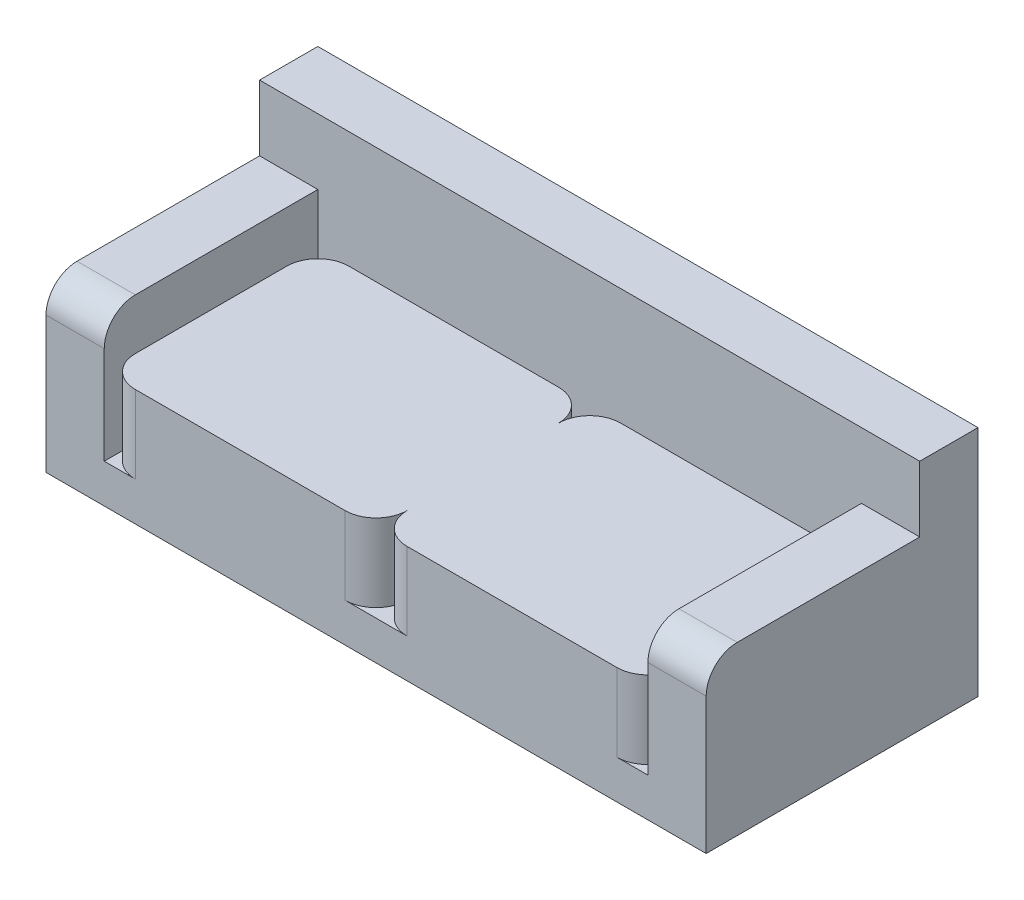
ISO-10303-21;
HEADER;
FILE_DESCRIPTION(('STEP AP214'),'2;1');
FILE_NAME('part.step','',(''),(''),'','','');
FILE_SCHEMA(('AUTOMOTIVE_DESIGN { 1 0 10303 214 1 1 1 1 }'));
ENDSEC;
DATA;
#1=APPLICATION_CONTEXT('core data for automotive mechanical design processes');
#2=APPLICATION_PROTOCOL_DEFINITION('international standard','automotive_design',2000,#1);
#3=PRODUCT_CONTEXT('',#1,'mechanical');
#4=PRODUCT('Part','Part','',(#3));
#5=PRODUCT_RELATED_PRODUCT_CATEGORY('part','',(#4));
#6=PRODUCT_DEFINITION_FORMATION('','',#4);
#7=PRODUCT_DEFINITION_CONTEXT('part definition',#1,'design');
#8=PRODUCT_DEFINITION('design','',#6,#7);
#9=PRODUCT_DEFINITION_SHAPE('','',#8);
#10=(LENGTH_UNIT() NAMED_UNIT(*) SI_UNIT(.MILLI.,.METRE.));
#11=(NAMED_UNIT(*) PLANE_ANGLE_UNIT() SI_UNIT($,.RADIAN.));
#12=(NAMED_UNIT(*) SI_UNIT($,.STERADIAN.) SOLID_ANGLE_UNIT());
#13=UNCERTAINTY_MEASURE_WITH_UNIT(LENGTH_MEASURE(1.E-05),#10,'distance_accuracy_value','');
#14=(GEOMETRIC_REPRESENTATION_CONTEXT(3) GLOBAL_UNCERTAINTY_ASSIGNED_CONTEXT((#13)) GLOBAL_UNIT_ASSIGNED_CONTEXT((#10,
#11,#12)) REPRESENTATION_CONTEXT('',''));
#15=CARTESIAN_POINT('',(0.,0.,0.));
#16=DIRECTION('',(0.,0.,1.));
#17=DIRECTION('',(1.,0.,0.));
#18=AXIS2_PLACEMENT_3D('',#15,#16,#17);
#19=CARTESIAN_POINT('',(0.,0.,0.));
#20=DIRECTION('',(0.,1.,0.));
#21=DIRECTION('',(0.,0.,1.));
#22=AXIS2_PLACEMENT_3D('',#19,#20,#21);
#23=PLANE('',#22);
#24=DIRECTION('',(1.,0.,0.));
#25=VECTOR('',#24,1.);
#26=CARTESIAN_POINT('',(1200.,0.,-275.));
#27=LINE('',#26,#25);
#28=CARTESIAN_POINT('',(-350.,0.,-275.));
#29=VERTEX_POINT('',#28);
#30=CARTESIAN_POINT('',(-270.,0.,-275.));
#31=VERTEX_POINT('',#30);
#32=EDGE_CURVE('E289',#29,#31,#27,.T.);
#33=ORIENTED_EDGE('',*,*,#32,.F.);
#34=DIRECTION('',(0.,0.,-1.));
#35=VECTOR('',#34,1.);
#36=CARTESIAN_POINT('',(-350.,0.,-275.));
#37=LINE('',#36,#35);
#38=CARTESIAN_POINT('',(-350.,0.,-195.));
#39=VERTEX_POINT('',#38);
#40=EDGE_CURVE('E232',#39,#29,#37,.T.);
#41=ORIENTED_EDGE('',*,*,#40,.F.);
#42=CARTESIAN_POINT('',(-270.,0.,-195.));
#43=DIRECTION('',(0.,1.,0.));
#44=DIRECTION('',(0.,0.,1.));
#45=AXIS2_PLACEMENT_3D('',#42,#43,#44);
#46=CIRCLE('',#45,80.);
#47=EDGE_CURVE('E417',#39,#31,#46,.F.);
#48=ORIENTED_EDGE('',*,*,#47,.T.);
#49=EDGE_LOOP('',(#33,#41,#48));
#50=FACE_BOUND('',#49,.T.);
#51=ADVANCED_FACE('F32',(#50),#23,.T.);
#52=CARTESIAN_POINT('',(-270.,0.,195.));
#53=DIRECTION('',(0.,1.,0.));
#54=DIRECTION('',(0.,0.,1.));
#55=AXIS2_PLACEMENT_3D('',#52,#53,#54);
#56=CIRCLE('',#55,80.);
#57=CARTESIAN_POINT('',(-270.,0.,275.));
#58=VERTEX_POINT('',#57);
#59=CARTESIAN_POINT('',(-350.,0.,195.));
#60=VERTEX_POINT('',#59);
#61=EDGE_CURVE('E421',#58,#60,#56,.F.);
#62=ORIENTED_EDGE('',*,*,#61,.T.);
#63=CARTESIAN_POINT('',(-350.,0.,275.));
#64=VERTEX_POINT('',#63);
#65=EDGE_CURVE('E235',#64,#60,#37,.T.);
#66=ORIENTED_EDGE('',*,*,#65,.F.);
#67=DIRECTION('',(-1.,0.,0.));
#68=VECTOR('',#67,1.);
#69=CARTESIAN_POINT('',(1200.,0.,275.));
#70=LINE('',#69,#68);
#71=EDGE_CURVE('E290',#58,#64,#70,.T.);
#72=ORIENTED_EDGE('',*,*,#71,.F.);
#73=EDGE_LOOP('',(#62,#66,#72));
#74=FACE_BOUND('',#73,.T.);
#75=ADVANCED_FACE('F442',(#74),#23,.T.);
#76=CARTESIAN_POINT('',(1050.,0.,275.));
#77=VERTEX_POINT('',#76);
#78=CARTESIAN_POINT('',(970.,0.,275.));
#79=VERTEX_POINT('',#78);
#80=EDGE_CURVE('E272',#77,#79,#70,.T.);
#81=ORIENTED_EDGE('',*,*,#80,.F.);
#82=DIRECTION('',(0.,0.,-1.));
#83=VECTOR('',#82,1.);
#84=CARTESIAN_POINT('',(1050.,0.,0.));
#85=LINE('',#84,#83);
#86=CARTESIAN_POINT('',(1050.,0.,195.));
#87=VERTEX_POINT('',#86);
#88=EDGE_CURVE('E374',#77,#87,#85,.T.);
#89=ORIENTED_EDGE('',*,*,#88,.T.);
#90=CARTESIAN_POINT('',(970.,0.,195.));
#91=DIRECTION('',(0.,1.,0.));
#92=DIRECTION('',(0.,0.,1.));
#93=AXIS2_PLACEMENT_3D('',#90,#91,#92);
#94=CIRCLE('',#93,80.);
#95=EDGE_CURVE('E386',#87,#79,#94,.F.);
#96=ORIENTED_EDGE('',*,*,#95,.T.);
#97=EDGE_LOOP('',(#81,#89,#96));
#98=FACE_BOUND('',#97,.T.);
#99=ADVANCED_FACE('F549',(#98),#23,.T.);
#100=CARTESIAN_POINT('',(970.,0.,-195.));
#101=DIRECTION('',(0.,1.,0.));
#102=DIRECTION('',(0.,0.,1.));
#103=AXIS2_PLACEMENT_3D('',#100,#101,#102);
#104=CIRCLE('',#103,80.);
#105=CARTESIAN_POINT('',(970.,0.,-275.));
#106=VERTEX_POINT('',#105);
#107=CARTESIAN_POINT('',(1050.,0.,-195.));
#108=VERTEX_POINT('',#107);
#109=EDGE_CURVE('E471',#106,#108,#104,.F.);
#110=ORIENTED_EDGE('',*,*,#109,.T.);
#111=DIRECTION('',(0.,0.,1.));
#112=VECTOR('',#111,1.);
#113=CARTESIAN_POINT('',(1050.,0.,-275.));
#114=LINE('',#113,#112);
#115=CARTESIAN_POINT('',(1050.,0.,-275.));
#116=VERTEX_POINT('',#115);
#117=EDGE_CURVE('E252',#116,#108,#114,.T.);
#118=ORIENTED_EDGE('',*,*,#117,.F.);
#119=EDGE_CURVE('E268',#106,#116,#27,.T.);
#120=ORIENTED_EDGE('',*,*,#119,.F.);
#121=EDGE_LOOP('',(#110,#118,#120));
#122=FACE_BOUND('',#121,.T.);
#123=ADVANCED_FACE('F551',(#122),#23,.T.);
#124=CARTESIAN_POINT('',(-350.,200.,275.));
#125=DIRECTION('',(0.,0.,-1.));
#126=DIRECTION('',(-1.,0.,0.));
#127=AXIS2_PLACEMENT_3D('',#124,#125,#126);
#128=PLANE('',#127);
#129=DIRECTION('',(0.,1.,0.));
#130=VECTOR('',#129,1.);
#131=CARTESIAN_POINT('',(1200.,-100.,275.));
#132=LINE('',#131,#130);
#133=CARTESIAN_POINT('',(1200.,-100.,275.));
#134=VERTEX_POINT('',#133);
#135=CARTESIAN_POINT('',(1200.,251.,275.));
#136=VERTEX_POINT('',#135);
#137=EDGE_CURVE('E296',#134,#136,#132,.T.);
#138=ORIENTED_EDGE('',*,*,#137,.T.);
#139=DIRECTION('',(1.,0.,0.));
#140=VECTOR('',#139,1.);
#141=CARTESIAN_POINT('',(-350.,251.,275.));
#142=LINE('',#141,#140);
#143=CARTESIAN_POINT('',(1050.,251.,275.));
#144=VERTEX_POINT('',#143);
#145=EDGE_CURVE('E332',#136,#144,#142,.F.);
#146=ORIENTED_EDGE('',*,*,#145,.T.);
#147=DIRECTION('',(0.,-1.,0.));
#148=VECTOR('',#147,1.);
#149=CARTESIAN_POINT('',(1050.,331.,275.));
#150=LINE('',#149,#148);
#151=EDGE_CURVE('E262',#144,#77,#150,.T.);
#152=ORIENTED_EDGE('',*,*,#151,.T.);
#153=ORIENTED_EDGE('',*,*,#80,.T.);
#154=DIRECTION('',(0.,-1.,0.));
#155=VECTOR('',#154,1.);
#156=CARTESIAN_POINT('',(970.,200.,275.));
#157=LINE('',#156,#155);
#158=CARTESIAN_POINT('',(970.,200.,275.));
#159=VERTEX_POINT('',#158);
#160=EDGE_CURVE('E387',#79,#159,#157,.F.);
#161=ORIENTED_EDGE('',*,*,#160,.T.);
#162=DIRECTION('',(1.,0.,0.));
#163=VECTOR('',#162,1.);
#164=CARTESIAN_POINT('',(350.,200.,275.));
#165=LINE('',#164,#163);
#166=CARTESIAN_POINT('',(430.,200.,275.));
#167=VERTEX_POINT('',#166);
#168=EDGE_CURVE('E518',#167,#159,#165,.T.);
#169=ORIENTED_EDGE('',*,*,#168,.F.);
#170=DIRECTION('',(0.,-1.,0.));
#171=VECTOR('',#170,1.);
#172=CARTESIAN_POINT('',(430.,200.,275.));
#173=LINE('',#172,#171);
#174=CARTESIAN_POINT('',(430.,0.,275.));
#175=VERTEX_POINT('',#174);
#176=EDGE_CURVE('E383',#167,#175,#173,.T.);
#177=ORIENTED_EDGE('',*,*,#176,.T.);
#178=CARTESIAN_POINT('',(270.,0.,275.));
#179=VERTEX_POINT('',#178);
#180=EDGE_CURVE('E293',#175,#179,#70,.T.);
#181=ORIENTED_EDGE('',*,*,#180,.T.);
#182=DIRECTION('',(0.,-1.,0.));
#183=VECTOR('',#182,1.);
#184=CARTESIAN_POINT('',(270.,200.,275.));
#185=LINE('',#184,#183);
#186=CARTESIAN_POINT('',(270.,200.,275.));
#187=VERTEX_POINT('',#186);
#188=EDGE_CURVE('E397',#179,#187,#185,.F.);
#189=ORIENTED_EDGE('',*,*,#188,.T.);
#190=DIRECTION('',(1.,0.,0.));
#191=VECTOR('',#190,1.);
#192=CARTESIAN_POINT('',(-350.,200.,275.));
#193=LINE('',#192,#191);
#194=CARTESIAN_POINT('',(-270.,200.,275.));
#195=VERTEX_POINT('',#194);
#196=EDGE_CURVE('E400',#195,#187,#193,.T.);
#197=ORIENTED_EDGE('',*,*,#196,.F.);
#198=DIRECTION('',(0.,-1.,0.));
#199=VECTOR('',#198,1.);
#200=CARTESIAN_POINT('',(-270.,200.,275.));
#201=LINE('',#200,#199);
#202=EDGE_CURVE('E399',#195,#58,#201,.T.);
#203=ORIENTED_EDGE('',*,*,#202,.T.);
#204=ORIENTED_EDGE('',*,*,#71,.T.);
#205=DIRECTION('',(0.,-1.,0.));
#206=VECTOR('',#205,1.);
#207=CARTESIAN_POINT('',(-350.,331.,275.));
#208=LINE('',#207,#206);
#209=CARTESIAN_POINT('',(-350.,251.,275.));
#210=VERTEX_POINT('',#209);
#211=EDGE_CURVE('E250',#210,#64,#208,.T.);
#212=ORIENTED_EDGE('',*,*,#211,.F.);
#213=DIRECTION('',(1.,0.,0.));
#214=VECTOR('',#213,1.);
#215=CARTESIAN_POINT('',(-500.,251.,275.));
#216=LINE('',#215,#214);
#217=CARTESIAN_POINT('',(-500.,251.,275.));
#218=VERTEX_POINT('',#217);
#219=EDGE_CURVE('E302',#210,#218,#216,.F.);
#220=ORIENTED_EDGE('',*,*,#219,.T.);
#221=DIRECTION('',(0.,1.,0.));
#222=VECTOR('',#221,1.);
#223=CARTESIAN_POINT('',(-500.,-100.,275.));
#224=LINE('',#223,#222);
#225=CARTESIAN_POINT('',(-500.,-100.,275.));
#226=VERTEX_POINT('',#225);
#227=EDGE_CURVE('E276',#226,#218,#224,.T.);
#228=ORIENTED_EDGE('',*,*,#227,.F.);
#229=DIRECTION('',(-1.,0.,0.));
#230=VECTOR('',#229,1.);
#231=CARTESIAN_POINT('',(1200.,-100.,275.));
#232=LINE('',#231,#230);
#233=EDGE_CURVE('E274',#134,#226,#232,.T.);
#234=ORIENTED_EDGE('',*,*,#233,.F.);
#235=EDGE_LOOP('',(#138,#146,#152,#153,#161,#169,#177,#181,#189,#197,#203,#204,#212,#220,#228,#234));
#236=FACE_BOUND('',#235,.T.);
#237=ADVANCED_FACE('F330',(#236),#128,.F.);
#238=CARTESIAN_POINT('',(0.,200.,0.));
#239=DIRECTION('',(0.,1.,0.));
#240=DIRECTION('',(0.,0.,1.));
#241=AXIS2_PLACEMENT_3D('',#238,#239,#240);
#242=PLANE('',#241);
#243=CARTESIAN_POINT('',(270.,200.,195.));
#244=DIRECTION('',(0.,1.,0.));
#245=DIRECTION('',(0.,0.,1.));
#246=AXIS2_PLACEMENT_3D('',#243,#244,#245);
#247=CIRCLE('',#246,80.);
#248=CARTESIAN_POINT('',(350.,200.,195.));
#249=VERTEX_POINT('',#248);
#250=EDGE_CURVE('E448',#187,#249,#247,.T.);
#251=ORIENTED_EDGE('',*,*,#250,.T.);
#252=CARTESIAN_POINT('',(430.,200.,195.));
#253=DIRECTION('',(0.,1.,0.));
#254=DIRECTION('',(0.,0.,1.));
#255=AXIS2_PLACEMENT_3D('',#252,#253,#254);
#256=CIRCLE('',#255,80.);
#257=EDGE_CURVE('E481',#249,#167,#256,.T.);
#258=ORIENTED_EDGE('',*,*,#257,.T.);
#259=ORIENTED_EDGE('',*,*,#168,.T.);
#260=CARTESIAN_POINT('',(970.,200.,195.));
#261=DIRECTION('',(0.,1.,0.));
#262=DIRECTION('',(0.,0.,1.));
#263=AXIS2_PLACEMENT_3D('',#260,#261,#262);
#264=CIRCLE('',#263,80.);
#265=CARTESIAN_POINT('',(1050.,200.,195.));
#266=VERTEX_POINT('',#265);
#267=EDGE_CURVE('E393',#159,#266,#264,.T.);
#268=ORIENTED_EDGE('',*,*,#267,.T.);
#269=DIRECTION('',(0.,0.,-1.));
#270=VECTOR('',#269,1.);
#271=CARTESIAN_POINT('',(1050.,200.,-275.));
#272=LINE('',#271,#270);
#273=CARTESIAN_POINT('',(1050.,200.,-195.));
#274=VERTEX_POINT('',#273);
#275=EDGE_CURVE('E298',#266,#274,#272,.T.);
#276=ORIENTED_EDGE('',*,*,#275,.T.);
#277=CARTESIAN_POINT('',(970.,200.,-195.));
#278=DIRECTION('',(0.,1.,0.));
#279=DIRECTION('',(0.,0.,1.));
#280=AXIS2_PLACEMENT_3D('',#277,#278,#279);
#281=CIRCLE('',#280,80.);
#282=CARTESIAN_POINT('',(970.,200.,-275.));
#283=VERTEX_POINT('',#282);
#284=EDGE_CURVE('E516',#274,#283,#281,.T.);
#285=ORIENTED_EDGE('',*,*,#284,.T.);
#286=DIRECTION('',(-1.,0.,0.));
#287=VECTOR('',#286,1.);
#288=CARTESIAN_POINT('',(350.,200.,-275.));
#289=LINE('',#288,#287);
#290=CARTESIAN_POINT('',(430.,200.,-275.));
#291=VERTEX_POINT('',#290);
#292=EDGE_CURVE('E510',#283,#291,#289,.T.);
#293=ORIENTED_EDGE('',*,*,#292,.T.);
#294=CARTESIAN_POINT('',(430.,200.,-195.));
#295=DIRECTION('',(0.,1.,0.));
#296=DIRECTION('',(0.,0.,1.));
#297=AXIS2_PLACEMENT_3D('',#294,#295,#296);
#298=CIRCLE('',#297,80.);
#299=CARTESIAN_POINT('',(350.,200.,-195.));
#300=VERTEX_POINT('',#299);
#301=EDGE_CURVE('E508',#291,#300,#298,.T.);
#302=ORIENTED_EDGE('',*,*,#301,.T.);
#303=CARTESIAN_POINT('',(270.,200.,-195.));
#304=DIRECTION('',(0.,1.,0.));
#305=DIRECTION('',(0.,0.,1.));
#306=AXIS2_PLACEMENT_3D('',#303,#304,#305);
#307=CIRCLE('',#306,80.);
#308=CARTESIAN_POINT('',(270.,200.,-275.));
#309=VERTEX_POINT('',#308);
#310=EDGE_CURVE('E449',#300,#309,#307,.T.);
#311=ORIENTED_EDGE('',*,*,#310,.T.);
#312=DIRECTION('',(-1.,0.,0.));
#313=VECTOR('',#312,1.);
#314=CARTESIAN_POINT('',(-350.,200.,-275.));
#315=LINE('',#314,#313);
#316=CARTESIAN_POINT('',(-270.,200.,-275.));
#317=VERTEX_POINT('',#316);
#318=EDGE_CURVE('E498',#309,#317,#315,.T.);
#319=ORIENTED_EDGE('',*,*,#318,.T.);
#320=CARTESIAN_POINT('',(-270.,200.,-195.));
#321=DIRECTION('',(0.,1.,0.));
#322=DIRECTION('',(0.,0.,1.));
#323=AXIS2_PLACEMENT_3D('',#320,#321,#322);
#324=CIRCLE('',#323,80.);
#325=CARTESIAN_POINT('',(-350.,200.,-195.));
#326=VERTEX_POINT('',#325);
#327=EDGE_CURVE('E454',#317,#326,#324,.T.);
#328=ORIENTED_EDGE('',*,*,#327,.T.);
#329=DIRECTION('',(0.,0.,1.));
#330=VECTOR('',#329,1.);
#331=CARTESIAN_POINT('',(-350.,200.,-275.));
#332=LINE('',#331,#330);
#333=CARTESIAN_POINT('',(-350.,200.,195.));
#334=VERTEX_POINT('',#333);
#335=EDGE_CURVE('E523',#326,#334,#332,.T.);
#336=ORIENTED_EDGE('',*,*,#335,.T.);
#337=CARTESIAN_POINT('',(-270.,200.,195.));
#338=DIRECTION('',(0.,1.,0.));
#339=DIRECTION('',(0.,0.,1.));
#340=AXIS2_PLACEMENT_3D('',#337,#338,#339);
#341=CIRCLE('',#340,80.);
#342=EDGE_CURVE('E447',#334,#195,#341,.T.);
#343=ORIENTED_EDGE('',*,*,#342,.T.);
#344=ORIENTED_EDGE('',*,*,#196,.T.);
#345=EDGE_LOOP('',(#251,#258,#259,#268,#276,#285,#293,#302,#311,#319,#328,#336,#343,#344));
#346=FACE_BOUND('',#345,.T.);
#347=ADVANCED_FACE('F513',(#346),#242,.T.);
#348=CARTESIAN_POINT('',(-270.,200.,195.));
#349=DIRECTION('',(0.,-1.,0.));
#350=DIRECTION('',(0.,0.,-1.));
#351=AXIS2_PLACEMENT_3D('',#348,#349,#350);
#352=CYLINDRICAL_SURFACE('',#351,80.);
#353=ORIENTED_EDGE('',*,*,#342,.F.);
#354=DIRECTION('',(0.,-1.,0.));
#355=VECTOR('',#354,1.);
#356=CARTESIAN_POINT('',(-350.,200.,195.));
#357=LINE('',#356,#355);
#358=EDGE_CURVE('E444',#60,#334,#357,.F.);
#359=ORIENTED_EDGE('',*,*,#358,.F.);
#360=ORIENTED_EDGE('',*,*,#61,.F.);
#361=ORIENTED_EDGE('',*,*,#202,.F.);
#362=EDGE_LOOP('',(#353,#359,#360,#361));
#363=FACE_BOUND('',#362,.T.);
#364=ADVANCED_FACE('F446',(#363),#352,.T.);
#365=CARTESIAN_POINT('',(-270.,200.,-195.));
#366=DIRECTION('',(0.,-1.,0.));
#367=DIRECTION('',(0.,0.,-1.));
#368=AXIS2_PLACEMENT_3D('',#365,#366,#367);
#369=CYLINDRICAL_SURFACE('',#368,80.);
#370=ORIENTED_EDGE('',*,*,#327,.F.);
#371=DIRECTION('',(0.,-1.,0.));
#372=VECTOR('',#371,1.);
#373=CARTESIAN_POINT('',(-270.,200.,-275.));
#374=LINE('',#373,#372);
#375=EDGE_CURVE('E424',#31,#317,#374,.F.);
#376=ORIENTED_EDGE('',*,*,#375,.F.);
#377=ORIENTED_EDGE('',*,*,#47,.F.);
#378=DIRECTION('',(0.,-1.,0.));
#379=VECTOR('',#378,1.);
#380=CARTESIAN_POINT('',(-350.,200.,-195.));
#381=LINE('',#380,#379);
#382=EDGE_CURVE('E414',#326,#39,#381,.T.);
#383=ORIENTED_EDGE('',*,*,#382,.F.);
#384=EDGE_LOOP('',(#370,#376,#377,#383));
#385=FACE_BOUND('',#384,.T.);
#386=ADVANCED_FACE('F791',(#385),#369,.T.);
#387=CARTESIAN_POINT('',(270.,200.,-195.));
#388=DIRECTION('',(0.,-1.,0.));
#389=DIRECTION('',(0.,0.,-1.));
#390=AXIS2_PLACEMENT_3D('',#387,#388,#389);
#391=CYLINDRICAL_SURFACE('',#390,80.);
#392=ORIENTED_EDGE('',*,*,#310,.F.);
#393=DIRECTION('',(0.,-1.,0.));
#394=VECTOR('',#393,1.);
#395=CARTESIAN_POINT('',(350.,200.,-195.));
#396=LINE('',#395,#394);
#397=CARTESIAN_POINT('',(350.,0.,-195.));
#398=VERTEX_POINT('',#397);
#399=EDGE_CURVE('E460',#398,#300,#396,.F.);
#400=ORIENTED_EDGE('',*,*,#399,.F.);
#401=CARTESIAN_POINT('',(270.,0.,-195.));
#402=DIRECTION('',(0.,1.,0.));
#403=DIRECTION('',(0.,0.,1.));
#404=AXIS2_PLACEMENT_3D('',#401,#402,#403);
#405=CIRCLE('',#404,80.);
#406=CARTESIAN_POINT('',(270.,0.,-275.));
#407=VERTEX_POINT('',#406);
#408=EDGE_CURVE('E405',#407,#398,#405,.F.);
#409=ORIENTED_EDGE('',*,*,#408,.F.);
#410=DIRECTION('',(0.,-1.,0.));
#411=VECTOR('',#410,1.);
#412=CARTESIAN_POINT('',(270.,200.,-275.));
#413=LINE('',#412,#411);
#414=EDGE_CURVE('E427',#309,#407,#413,.T.);
#415=ORIENTED_EDGE('',*,*,#414,.F.);
#416=EDGE_LOOP('',(#392,#400,#409,#415));
#417=FACE_BOUND('',#416,.T.);
#418=ADVANCED_FACE('F502',(#417),#391,.T.);
#419=CARTESIAN_POINT('',(270.,200.,195.));
#420=DIRECTION('',(0.,-1.,0.));
#421=DIRECTION('',(0.,0.,-1.));
#422=AXIS2_PLACEMENT_3D('',#419,#420,#421);
#423=CYLINDRICAL_SURFACE('',#422,80.);
#424=ORIENTED_EDGE('',*,*,#250,.F.);
#425=ORIENTED_EDGE('',*,*,#188,.F.);
#426=CARTESIAN_POINT('',(270.,0.,195.));
#427=DIRECTION('',(0.,1.,0.));
#428=DIRECTION('',(0.,0.,1.));
#429=AXIS2_PLACEMENT_3D('',#426,#427,#428);
#430=CIRCLE('',#429,80.);
#431=CARTESIAN_POINT('',(350.,0.,195.));
#432=VERTEX_POINT('',#431);
#433=EDGE_CURVE('E401',#432,#179,#430,.F.);
#434=ORIENTED_EDGE('',*,*,#433,.F.);
#435=DIRECTION('',(0.,-1.,0.));
#436=VECTOR('',#435,1.);
#437=CARTESIAN_POINT('',(350.,200.,195.));
#438=LINE('',#437,#436);
#439=EDGE_CURVE('E426',#249,#432,#438,.T.);
#440=ORIENTED_EDGE('',*,*,#439,.F.);
#441=EDGE_LOOP('',(#424,#425,#434,#440));
#442=FACE_BOUND('',#441,.T.);
#443=ADVANCED_FACE('F527',(#442),#423,.T.);
#444=CARTESIAN_POINT('',(430.,200.,195.));
#445=DIRECTION('',(0.,-1.,0.));
#446=DIRECTION('',(0.,0.,-1.));
#447=AXIS2_PLACEMENT_3D('',#444,#445,#446);
#448=CYLINDRICAL_SURFACE('',#447,80.);
#449=ORIENTED_EDGE('',*,*,#257,.F.);
#450=ORIENTED_EDGE('',*,*,#439,.T.);
#451=CARTESIAN_POINT('',(430.,0.,195.));
#452=DIRECTION('',(0.,1.,0.));
#453=DIRECTION('',(0.,0.,1.));
#454=AXIS2_PLACEMENT_3D('',#451,#452,#453);
#455=CIRCLE('',#454,80.);
#456=EDGE_CURVE('E390',#175,#432,#455,.F.);
#457=ORIENTED_EDGE('',*,*,#456,.F.);
#458=ORIENTED_EDGE('',*,*,#176,.F.);
#459=EDGE_LOOP('',(#449,#450,#457,#458));
#460=FACE_BOUND('',#459,.T.);
#461=ADVANCED_FACE('F531',(#460),#448,.T.);
#462=CARTESIAN_POINT('',(430.,200.,-195.));
#463=DIRECTION('',(0.,-1.,0.));
#464=DIRECTION('',(0.,0.,-1.));
#465=AXIS2_PLACEMENT_3D('',#462,#463,#464);
#466=CYLINDRICAL_SURFACE('',#465,80.);
#467=ORIENTED_EDGE('',*,*,#301,.F.);
#468=DIRECTION('',(0.,-1.,0.));
#469=VECTOR('',#468,1.);
#470=CARTESIAN_POINT('',(430.,200.,-275.));
#471=LINE('',#470,#469);
#472=CARTESIAN_POINT('',(430.,0.,-275.));
#473=VERTEX_POINT('',#472);
#474=EDGE_CURVE('E480',#473,#291,#471,.F.);
#475=ORIENTED_EDGE('',*,*,#474,.F.);
#476=CARTESIAN_POINT('',(430.,0.,-195.));
#477=DIRECTION('',(0.,1.,0.));
#478=DIRECTION('',(0.,0.,1.));
#479=AXIS2_PLACEMENT_3D('',#476,#477,#478);
#480=CIRCLE('',#479,80.);
#481=EDGE_CURVE('E394',#398,#473,#480,.F.);
#482=ORIENTED_EDGE('',*,*,#481,.F.);
#483=ORIENTED_EDGE('',*,*,#399,.T.);
#484=EDGE_LOOP('',(#467,#475,#482,#483));
#485=FACE_BOUND('',#484,.T.);
#486=ADVANCED_FACE('F507',(#485),#466,.T.);
#487=CARTESIAN_POINT('',(970.,200.,-195.));
#488=DIRECTION('',(0.,-1.,0.));
#489=DIRECTION('',(0.,0.,-1.));
#490=AXIS2_PLACEMENT_3D('',#487,#488,#489);
#491=CYLINDRICAL_SURFACE('',#490,80.);
#492=ORIENTED_EDGE('',*,*,#284,.F.);
#493=DIRECTION('',(0.,-1.,0.));
#494=VECTOR('',#493,1.);
#495=CARTESIAN_POINT('',(1050.,200.,-195.));
#496=LINE('',#495,#494);
#497=EDGE_CURVE('E377',#108,#274,#496,.F.);
#498=ORIENTED_EDGE('',*,*,#497,.F.);
#499=ORIENTED_EDGE('',*,*,#109,.F.);
#500=DIRECTION('',(0.,-1.,0.));
#501=VECTOR('',#500,1.);
#502=CARTESIAN_POINT('',(970.,200.,-275.));
#503=LINE('',#502,#501);
#504=EDGE_CURVE('E478',#283,#106,#503,.T.);
#505=ORIENTED_EDGE('',*,*,#504,.F.);
#506=EDGE_LOOP('',(#492,#498,#499,#505));
#507=FACE_BOUND('',#506,.T.);
#508=ADVANCED_FACE('F572',(#507),#491,.T.);
#509=CARTESIAN_POINT('',(970.,200.,195.));
#510=DIRECTION('',(0.,-1.,0.));
#511=DIRECTION('',(0.,0.,-1.));
#512=AXIS2_PLACEMENT_3D('',#509,#510,#511);
#513=CYLINDRICAL_SURFACE('',#512,80.);
#514=ORIENTED_EDGE('',*,*,#267,.F.);
#515=ORIENTED_EDGE('',*,*,#160,.F.);
#516=ORIENTED_EDGE('',*,*,#95,.F.);
#517=DIRECTION('',(0.,-1.,0.));
#518=VECTOR('',#517,1.);
#519=CARTESIAN_POINT('',(1050.,200.,195.));
#520=LINE('',#519,#518);
#521=EDGE_CURVE('E487',#266,#87,#520,.T.);
#522=ORIENTED_EDGE('',*,*,#521,.F.);
#523=EDGE_LOOP('',(#514,#515,#516,#522));
#524=FACE_BOUND('',#523,.T.);
#525=ADVANCED_FACE('F545',(#524),#513,.T.);
#526=ORIENTED_EDGE('',*,*,#180,.F.);
#527=ORIENTED_EDGE('',*,*,#456,.T.);
#528=ORIENTED_EDGE('',*,*,#433,.T.);
#529=EDGE_LOOP('',(#526,#527,#528));
#530=FACE_BOUND('',#529,.T.);
#531=ADVANCED_FACE('F558',(#530),#23,.T.);
#532=EDGE_CURVE('E287',#407,#473,#27,.T.);
#533=ORIENTED_EDGE('',*,*,#532,.F.);
#534=ORIENTED_EDGE('',*,*,#408,.T.);
#535=ORIENTED_EDGE('',*,*,#481,.T.);
#536=EDGE_LOOP('',(#533,#534,#535));
#537=FACE_BOUND('',#536,.T.);
#538=ADVANCED_FACE('F504',(#537),#23,.T.);
#539=CARTESIAN_POINT('',(-500.,-100.,275.));
#540=DIRECTION('',(1.,0.,0.));
#541=DIRECTION('',(0.,0.,-1.));
#542=AXIS2_PLACEMENT_3D('',#539,#540,#541);
#543=PLANE('',#542);
#544=ORIENTED_EDGE('',*,*,#227,.T.);
#545=CARTESIAN_POINT('',(-500.,251.,195.));
#546=DIRECTION('',(1.,0.,0.));
#547=DIRECTION('',(0.,0.,-1.));
#548=AXIS2_PLACEMENT_3D('',#545,#546,#547);
#549=CIRCLE('',#548,80.);
#550=CARTESIAN_POINT('',(-500.,331.,195.));
#551=VERTEX_POINT('',#550);
#552=EDGE_CURVE('E55',#218,#551,#549,.F.);
#553=ORIENTED_EDGE('',*,*,#552,.T.);
#554=DIRECTION('',(0.,0.,1.));
#555=VECTOR('',#554,1.);
#556=CARTESIAN_POINT('',(-500.,331.,-275.));
#557=LINE('',#556,#555);
#558=CARTESIAN_POINT('',(-500.,331.,-275.));
#559=VERTEX_POINT('',#558);
#560=EDGE_CURVE('E240',#559,#551,#557,.T.);
#561=ORIENTED_EDGE('',*,*,#560,.F.);
#562=DIRECTION('',(0.,1.,0.));
#563=VECTOR('',#562,1.);
#564=CARTESIAN_POINT('',(-500.,-100.,-275.));
#565=LINE('',#564,#563);
#566=CARTESIAN_POINT('',(-500.,500.,-275.));
#567=VERTEX_POINT('',#566);
#568=EDGE_CURVE('E230',#559,#567,#565,.T.);
#569=ORIENTED_EDGE('',*,*,#568,.T.);
#570=DIRECTION('',(0.,0.,1.));
#571=VECTOR('',#570,1.);
#572=CARTESIAN_POINT('',(-500.,500.,-425.));
#573=LINE('',#572,#571);
#574=CARTESIAN_POINT('',(-500.,500.,-425.));
#575=VERTEX_POINT('',#574);
#576=EDGE_CURVE('E212',#575,#567,#573,.T.);
#577=ORIENTED_EDGE('',*,*,#576,.F.);
#578=DIRECTION('',(0.,1.,0.));
#579=VECTOR('',#578,1.);
#580=CARTESIAN_POINT('',(-500.,-100.,-425.));
#581=LINE('',#580,#579);
#582=CARTESIAN_POINT('',(-500.,-100.,-425.));
#583=VERTEX_POINT('',#582);
#584=EDGE_CURVE('E219',#583,#575,#581,.T.);
#585=ORIENTED_EDGE('',*,*,#584,.F.);
#586=DIRECTION('',(0.,0.,-1.));
#587=VECTOR('',#586,1.);
#588=CARTESIAN_POINT('',(-500.,-100.,275.));
#589=LINE('',#588,#587);
#590=EDGE_CURVE('E269',#226,#583,#589,.T.);
#591=ORIENTED_EDGE('',*,*,#590,.F.);
#592=EDGE_LOOP('',(#544,#553,#561,#569,#577,#585,#591));
#593=FACE_BOUND('',#592,.T.);
#594=ADVANCED_FACE('F229',(#593),#543,.F.);
#595=CARTESIAN_POINT('',(1200.,-100.,275.));
#596=DIRECTION('',(-1.,0.,0.));
#597=DIRECTION('',(0.,0.,1.));
#598=AXIS2_PLACEMENT_3D('',#595,#596,#597);
#599=PLANE('',#598);
#600=DIRECTION('',(0.,0.,-1.));
#601=VECTOR('',#600,1.);
#602=CARTESIAN_POINT('',(1200.,331.,-275.));
#603=LINE('',#602,#601);
#604=CARTESIAN_POINT('',(1200.,331.,195.));
#605=VERTEX_POINT('',#604);
#606=CARTESIAN_POINT('',(1200.,331.,-275.));
#607=VERTEX_POINT('',#606);
#608=EDGE_CURVE('E253',#605,#607,#603,.T.);
#609=ORIENTED_EDGE('',*,*,#608,.F.);
#610=CARTESIAN_POINT('',(1200.,251.,195.));
#611=DIRECTION('',(-1.,0.,0.));
#612=DIRECTION('',(0.,0.,1.));
#613=AXIS2_PLACEMENT_3D('',#610,#611,#612);
#614=CIRCLE('',#613,80.);
#615=EDGE_CURVE('E339',#605,#136,#614,.F.);
#616=ORIENTED_EDGE('',*,*,#615,.T.);
#617=ORIENTED_EDGE('',*,*,#137,.F.);
#618=DIRECTION('',(0.,0.,1.));
#619=VECTOR('',#618,1.);
#620=CARTESIAN_POINT('',(1200.,-100.,275.));
#621=LINE('',#620,#619);
#622=CARTESIAN_POINT('',(1200.,-100.,-425.));
#623=VERTEX_POINT('',#622);
#624=EDGE_CURVE('E271',#623,#134,#621,.T.);
#625=ORIENTED_EDGE('',*,*,#624,.F.);
#626=DIRECTION('',(0.,-1.,0.));
#627=VECTOR('',#626,1.);
#628=CARTESIAN_POINT('',(1200.,-100.,-425.));
#629=LINE('',#628,#627);
#630=CARTESIAN_POINT('',(1200.,500.,-425.));
#631=VERTEX_POINT('',#630);
#632=EDGE_CURVE('E218',#631,#623,#629,.T.);
#633=ORIENTED_EDGE('',*,*,#632,.F.);
#634=DIRECTION('',(0.,0.,1.));
#635=VECTOR('',#634,1.);
#636=CARTESIAN_POINT('',(1200.,500.,-425.));
#637=LINE('',#636,#635);
#638=CARTESIAN_POINT('',(1200.,500.,-275.));
#639=VERTEX_POINT('',#638);
#640=EDGE_CURVE('E214',#631,#639,#637,.T.);
#641=ORIENTED_EDGE('',*,*,#640,.T.);
#642=DIRECTION('',(0.,-1.,0.));
#643=VECTOR('',#642,1.);
#644=CARTESIAN_POINT('',(1200.,-100.,-275.));
#645=LINE('',#644,#643);
#646=EDGE_CURVE('E227',#639,#607,#645,.T.);
#647=ORIENTED_EDGE('',*,*,#646,.T.);
#648=EDGE_LOOP('',(#609,#616,#617,#625,#633,#641,#647));
#649=FACE_BOUND('',#648,.T.);
#650=ADVANCED_FACE('F322',(#649),#599,.F.);
#651=CARTESIAN_POINT('',(0.,-100.,0.));
#652=DIRECTION('',(0.,1.,0.));
#653=DIRECTION('',(0.,0.,1.));
#654=AXIS2_PLACEMENT_3D('',#651,#652,#653);
#655=PLANE('',#654);
#656=CARTESIAN_POINT('',(-400.,-100.,-325.));
#657=DIRECTION('',(0.,1.,0.));
#658=DIRECTION('',(0.,0.,1.));
#659=AXIS2_PLACEMENT_3D('',#656,#657,#658);
#660=CIRCLE('',#659,50.);
#661=CARTESIAN_POINT('',(-400.,-100.,-275.));
#662=VERTEX_POINT('',#661);
#663=EDGE_CURVE('E11',#662,#662,#660,.F.);
#664=ORIENTED_EDGE('',*,*,#663,.F.);
#665=EDGE_LOOP('',(#664));
#666=FACE_BOUND('',#665,.T.);
#667=CARTESIAN_POINT('',(1100.,-100.,-325.));
#668=DIRECTION('',(0.,1.,0.));
#669=DIRECTION('',(0.,0.,1.));
#670=AXIS2_PLACEMENT_3D('',#667,#668,#669);
#671=CIRCLE('',#670,50.);
#672=CARTESIAN_POINT('',(1100.,-100.,-275.));
#673=VERTEX_POINT('',#672);
#674=EDGE_CURVE('E40',#673,#673,#671,.F.);
#675=ORIENTED_EDGE('',*,*,#674,.F.);
#676=EDGE_LOOP('',(#675));
#677=FACE_BOUND('',#676,.T.);
#678=CARTESIAN_POINT('',(1100.,-100.,175.));
#679=DIRECTION('',(0.,1.,0.));
#680=DIRECTION('',(0.,0.,1.));
#681=AXIS2_PLACEMENT_3D('',#678,#679,#680);
#682=CIRCLE('',#681,50.);
#683=CARTESIAN_POINT('',(1100.,-100.,225.));
#684=VERTEX_POINT('',#683);
#685=EDGE_CURVE('E307',#684,#684,#682,.F.);
#686=ORIENTED_EDGE('',*,*,#685,.F.);
#687=EDGE_LOOP('',(#686));
#688=FACE_BOUND('',#687,.T.);
#689=CARTESIAN_POINT('',(-400.,-100.,175.));
#690=DIRECTION('',(0.,1.,0.));
#691=DIRECTION('',(0.,0.,1.));
#692=AXIS2_PLACEMENT_3D('',#689,#690,#691);
#693=CIRCLE('',#692,50.0000000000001);
#694=CARTESIAN_POINT('',(-400.,-100.,225.));
#695=VERTEX_POINT('',#694);
#696=EDGE_CURVE('E304',#695,#695,#693,.F.);
#697=ORIENTED_EDGE('',*,*,#696,.F.);
#698=EDGE_LOOP('',(#697));
#699=FACE_BOUND('',#698,.T.);
#700=ORIENTED_EDGE('',*,*,#590,.T.);
#701=DIRECTION('',(-1.,0.,0.));
#702=VECTOR('',#701,1.);
#703=CARTESIAN_POINT('',(-500.,-100.,-425.));
#704=LINE('',#703,#702);
#705=EDGE_CURVE('E225',#623,#583,#704,.T.);
#706=ORIENTED_EDGE('',*,*,#705,.F.);
#707=ORIENTED_EDGE('',*,*,#624,.T.);
#708=ORIENTED_EDGE('',*,*,#233,.T.);
#709=EDGE_LOOP('',(#700,#706,#707,#708));
#710=FACE_BOUND('',#709,.T.);
#711=ADVANCED_FACE('F318',(#666,#677,#688,#699,#710),#655,.F.);
#712=CARTESIAN_POINT('',(1050.,331.,-275.));
#713=DIRECTION('',(1.,0.,0.));
#714=DIRECTION('',(0.,0.,-1.));
#715=AXIS2_PLACEMENT_3D('',#712,#713,#714);
#716=PLANE('',#715);
#717=ORIENTED_EDGE('',*,*,#151,.F.);
#718=CARTESIAN_POINT('',(1050.,251.,195.));
#719=DIRECTION('',(1.,0.,0.));
#720=DIRECTION('',(0.,0.,-1.));
#721=AXIS2_PLACEMENT_3D('',#718,#719,#720);
#722=CIRCLE('',#721,80.);
#723=CARTESIAN_POINT('',(1050.,331.,195.));
#724=VERTEX_POINT('',#723);
#725=EDGE_CURVE('E341',#144,#724,#722,.F.);
#726=ORIENTED_EDGE('',*,*,#725,.T.);
#727=DIRECTION('',(0.,0.,1.));
#728=VECTOR('',#727,1.);
#729=CARTESIAN_POINT('',(1050.,331.,-275.));
#730=LINE('',#729,#728);
#731=CARTESIAN_POINT('',(1050.,331.,-275.));
#732=VERTEX_POINT('',#731);
#733=EDGE_CURVE('E259',#732,#724,#730,.T.);
#734=ORIENTED_EDGE('',*,*,#733,.F.);
#735=DIRECTION('',(0.,-1.,0.));
#736=VECTOR('',#735,1.);
#737=CARTESIAN_POINT('',(1050.,331.,-275.));
#738=LINE('',#737,#736);
#739=EDGE_CURVE('E265',#732,#116,#738,.T.);
#740=ORIENTED_EDGE('',*,*,#739,.T.);
#741=ORIENTED_EDGE('',*,*,#117,.T.);
#742=ORIENTED_EDGE('',*,*,#497,.T.);
#743=ORIENTED_EDGE('',*,*,#275,.F.);
#744=ORIENTED_EDGE('',*,*,#521,.T.);
#745=ORIENTED_EDGE('',*,*,#88,.F.);
#746=EDGE_LOOP('',(#717,#726,#734,#740,#741,#742,#743,#744,#745));
#747=FACE_BOUND('',#746,.T.);
#748=ADVANCED_FACE('F321',(#747),#716,.F.);
#749=CARTESIAN_POINT('',(0.,331.,0.));
#750=DIRECTION('',(0.,-1.,0.));
#751=DIRECTION('',(0.,0.,-1.));
#752=AXIS2_PLACEMENT_3D('',#749,#750,#751);
#753=PLANE('',#752);
#754=ORIENTED_EDGE('',*,*,#733,.T.);
#755=DIRECTION('',(1.,0.,0.));
#756=VECTOR('',#755,1.);
#757=CARTESIAN_POINT('',(0.,331.,195.));
#758=LINE('',#757,#756);
#759=EDGE_CURVE('E373',#724,#605,#758,.T.);
#760=ORIENTED_EDGE('',*,*,#759,.T.);
#761=ORIENTED_EDGE('',*,*,#608,.T.);
#762=DIRECTION('',(-1.,0.,0.));
#763=VECTOR('',#762,1.);
#764=CARTESIAN_POINT('',(1200.,331.,-275.));
#765=LINE('',#764,#763);
#766=EDGE_CURVE('E256',#607,#732,#765,.T.);
#767=ORIENTED_EDGE('',*,*,#766,.T.);
#768=EDGE_LOOP('',(#754,#760,#761,#767));
#769=FACE_BOUND('',#768,.T.);
#770=ADVANCED_FACE('F371',(#769),#753,.F.);
#771=CARTESIAN_POINT('',(-350.,331.,-275.));
#772=DIRECTION('',(-1.,0.,0.));
#773=DIRECTION('',(0.,0.,1.));
#774=AXIS2_PLACEMENT_3D('',#771,#772,#773);
#775=PLANE('',#774);
#776=DIRECTION('',(0.,0.,-1.));
#777=VECTOR('',#776,1.);
#778=CARTESIAN_POINT('',(-350.,331.,-275.));
#779=LINE('',#778,#777);
#780=CARTESIAN_POINT('',(-350.,331.,195.));
#781=VERTEX_POINT('',#780);
#782=CARTESIAN_POINT('',(-350.,331.,-275.));
#783=VERTEX_POINT('',#782);
#784=EDGE_CURVE('E242',#781,#783,#779,.T.);
#785=ORIENTED_EDGE('',*,*,#784,.F.);
#786=CARTESIAN_POINT('',(-350.,251.,195.));
#787=DIRECTION('',(-1.,0.,0.));
#788=DIRECTION('',(0.,0.,1.));
#789=AXIS2_PLACEMENT_3D('',#786,#787,#788);
#790=CIRCLE('',#789,80.);
#791=EDGE_CURVE('E47',#781,#210,#790,.F.);
#792=ORIENTED_EDGE('',*,*,#791,.T.);
#793=ORIENTED_EDGE('',*,*,#211,.T.);
#794=ORIENTED_EDGE('',*,*,#65,.T.);
#795=ORIENTED_EDGE('',*,*,#358,.T.);
#796=ORIENTED_EDGE('',*,*,#335,.F.);
#797=ORIENTED_EDGE('',*,*,#382,.T.);
#798=ORIENTED_EDGE('',*,*,#40,.T.);
#799=DIRECTION('',(0.,-1.,0.));
#800=VECTOR('',#799,1.);
#801=CARTESIAN_POINT('',(-350.,331.,-275.));
#802=LINE('',#801,#800);
#803=EDGE_CURVE('E247',#783,#29,#802,.T.);
#804=ORIENTED_EDGE('',*,*,#803,.F.);
#805=EDGE_LOOP('',(#785,#792,#793,#794,#795,#796,#797,#798,#804));
#806=FACE_BOUND('',#805,.T.);
#807=ADVANCED_FACE('F351',(#806),#775,.F.);
#808=CARTESIAN_POINT('',(0.,331.,0.));
#809=DIRECTION('',(0.,1.,0.));
#810=DIRECTION('',(0.,0.,1.));
#811=AXIS2_PLACEMENT_3D('',#808,#809,#810);
#812=PLANE('',#811);
#813=ORIENTED_EDGE('',*,*,#560,.T.);
#814=DIRECTION('',(1.,0.,0.));
#815=VECTOR('',#814,1.);
#816=CARTESIAN_POINT('',(-350.,331.,195.));
#817=LINE('',#816,#815);
#818=EDGE_CURVE('E303',#551,#781,#817,.T.);
#819=ORIENTED_EDGE('',*,*,#818,.T.);
#820=ORIENTED_EDGE('',*,*,#784,.T.);
#821=DIRECTION('',(-1.,0.,0.));
#822=VECTOR('',#821,1.);
#823=CARTESIAN_POINT('',(-500.,331.,-275.));
#824=LINE('',#823,#822);
#825=EDGE_CURVE('E245',#783,#559,#824,.T.);
#826=ORIENTED_EDGE('',*,*,#825,.T.);
#827=EDGE_LOOP('',(#813,#819,#820,#826));
#828=FACE_BOUND('',#827,.T.);
#829=ADVANCED_FACE('F348',(#828),#812,.T.);
#830=CARTESIAN_POINT('',(0.,251.,195.));
#831=DIRECTION('',(1.,0.,0.));
#832=DIRECTION('',(0.,0.,-1.));
#833=AXIS2_PLACEMENT_3D('',#830,#831,#832);
#834=CYLINDRICAL_SURFACE('',#833,80.);
#835=ORIENTED_EDGE('',*,*,#725,.F.);
#836=ORIENTED_EDGE('',*,*,#145,.F.);
#837=ORIENTED_EDGE('',*,*,#615,.F.);
#838=ORIENTED_EDGE('',*,*,#759,.F.);
#839=EDGE_LOOP('',(#835,#836,#837,#838));
#840=FACE_BOUND('',#839,.T.);
#841=ADVANCED_FACE('F337',(#840),#834,.T.);
#842=CARTESIAN_POINT('',(0.,251.,195.));
#843=DIRECTION('',(-1.,0.,0.));
#844=DIRECTION('',(0.,0.,1.));
#845=AXIS2_PLACEMENT_3D('',#842,#843,#844);
#846=CYLINDRICAL_SURFACE('',#845,80.);
#847=ORIENTED_EDGE('',*,*,#552,.F.);
#848=ORIENTED_EDGE('',*,*,#219,.F.);
#849=ORIENTED_EDGE('',*,*,#791,.F.);
#850=ORIENTED_EDGE('',*,*,#818,.F.);
#851=EDGE_LOOP('',(#847,#848,#849,#850));
#852=FACE_BOUND('',#851,.T.);
#853=ADVANCED_FACE('F34',(#852),#846,.T.);
#854=CARTESIAN_POINT('',(0.,0.,-275.));
#855=DIRECTION('',(0.,0.,-1.));
#856=DIRECTION('',(-1.,0.,0.));
#857=AXIS2_PLACEMENT_3D('',#854,#855,#856);
#858=PLANE('',#857);
#859=ORIENTED_EDGE('',*,*,#739,.F.);
#860=ORIENTED_EDGE('',*,*,#766,.F.);
#861=ORIENTED_EDGE('',*,*,#646,.F.);
#862=DIRECTION('',(1.,0.,0.));
#863=VECTOR('',#862,1.);
#864=CARTESIAN_POINT('',(-500.,500.,-275.));
#865=LINE('',#864,#863);
#866=EDGE_CURVE('E359',#567,#639,#865,.T.);
#867=ORIENTED_EDGE('',*,*,#866,.F.);
#868=ORIENTED_EDGE('',*,*,#568,.F.);
#869=ORIENTED_EDGE('',*,*,#825,.F.);
#870=ORIENTED_EDGE('',*,*,#803,.T.);
#871=ORIENTED_EDGE('',*,*,#32,.T.);
#872=ORIENTED_EDGE('',*,*,#375,.T.);
#873=ORIENTED_EDGE('',*,*,#318,.F.);
#874=ORIENTED_EDGE('',*,*,#414,.T.);
#875=ORIENTED_EDGE('',*,*,#532,.T.);
#876=ORIENTED_EDGE('',*,*,#474,.T.);
#877=ORIENTED_EDGE('',*,*,#292,.F.);
#878=ORIENTED_EDGE('',*,*,#504,.T.);
#879=ORIENTED_EDGE('',*,*,#119,.T.);
#880=EDGE_LOOP('',(#859,#860,#861,#867,#868,#869,#870,#871,#872,#873,#874,#875,#876,#877,#878,#879));
#881=FACE_BOUND('',#880,.T.);
#882=ADVANCED_FACE('F356',(#881),#858,.F.);
#883=CARTESIAN_POINT('',(-500.,500.,-425.));
#884=DIRECTION('',(0.,-1.,0.));
#885=DIRECTION('',(1.,0.,0.));
#886=AXIS2_PLACEMENT_3D('',#883,#884,#885);
#887=PLANE('',#886);
#888=ORIENTED_EDGE('',*,*,#866,.T.);
#889=ORIENTED_EDGE('',*,*,#640,.F.);
#890=DIRECTION('',(1.,0.,0.));
#891=VECTOR('',#890,1.);
#892=CARTESIAN_POINT('',(-500.,500.,-425.));
#893=LINE('',#892,#891);
#894=EDGE_CURVE('E208',#575,#631,#893,.T.);
#895=ORIENTED_EDGE('',*,*,#894,.F.);
#896=ORIENTED_EDGE('',*,*,#576,.T.);
#897=EDGE_LOOP('',(#888,#889,#895,#896));
#898=FACE_BOUND('',#897,.T.);
#899=ADVANCED_FACE('F210',(#898),#887,.F.);
#900=CARTESIAN_POINT('',(0.,0.,-425.));
#901=DIRECTION('',(0.,0.,-1.));
#902=DIRECTION('',(-1.,0.,0.));
#903=AXIS2_PLACEMENT_3D('',#900,#901,#902);
#904=PLANE('',#903);
#905=ORIENTED_EDGE('',*,*,#584,.T.);
#906=ORIENTED_EDGE('',*,*,#894,.T.);
#907=ORIENTED_EDGE('',*,*,#632,.T.);
#908=ORIENTED_EDGE('',*,*,#705,.T.);
#909=EDGE_LOOP('',(#905,#906,#907,#908));
#910=FACE_BOUND('',#909,.T.);
#911=ADVANCED_FACE('F223',(#910),#904,.T.);
#912=CARTESIAN_POINT('',(-400.,-150.,175.));
#913=DIRECTION('',(0.,1.,0.));
#914=DIRECTION('',(0.,0.,1.));
#915=AXIS2_PLACEMENT_3D('',#912,#913,#914);
#916=CYLINDRICAL_SURFACE('',#915,50.0000000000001);
#917=CARTESIAN_POINT('',(-400.,-150.,175.));
#918=DIRECTION('',(0.,-1.,0.));
#919=DIRECTION('',(0.,0.,-1.));
#920=AXIS2_PLACEMENT_3D('',#917,#918,#919);
#921=CIRCLE('',#920,50.0000000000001);
#922=CARTESIAN_POINT('',(-400.,-150.,125.));
#923=VERTEX_POINT('',#922);
#924=EDGE_CURVE('E360',#923,#923,#921,.T.);
#925=ORIENTED_EDGE('',*,*,#924,.F.);
#926=EDGE_LOOP('',(#925));
#927=FACE_BOUND('',#926,.T.);
#928=ORIENTED_EDGE('',*,*,#696,.T.);
#929=EDGE_LOOP('',(#928));
#930=FACE_BOUND('',#929,.T.);
#931=ADVANCED_FACE('F639',(#927,#930),#916,.T.);
#932=CARTESIAN_POINT('',(-400.,-150.,175.));
#933=DIRECTION('',(0.,-1.,0.));
#934=DIRECTION('',(0.,0.,-1.));
#935=AXIS2_PLACEMENT_3D('',#932,#933,#934);
#936=PLANE('',#935);
#937=ORIENTED_EDGE('',*,*,#924,.T.);
#938=EDGE_LOOP('',(#937));
#939=FACE_BOUND('',#938,.T.);
#940=ADVANCED_FACE('F654',(#939),#936,.T.);
#941=CARTESIAN_POINT('',(1100.,-150.,175.));
#942=DIRECTION('',(0.,1.,0.));
#943=DIRECTION('',(0.,0.,1.));
#944=AXIS2_PLACEMENT_3D('',#941,#942,#943);
#945=CYLINDRICAL_SURFACE('',#944,50.);
#946=CARTESIAN_POINT('',(1100.,-150.,175.));
#947=DIRECTION('',(0.,-1.,0.));
#948=DIRECTION('',(0.,0.,-1.));
#949=AXIS2_PLACEMENT_3D('',#946,#947,#948);
#950=CIRCLE('',#949,50.);
#951=CARTESIAN_POINT('',(1100.,-150.,125.));
#952=VERTEX_POINT('',#951);
#953=EDGE_CURVE('E364',#952,#952,#950,.T.);
#954=ORIENTED_EDGE('',*,*,#953,.F.);
#955=EDGE_LOOP('',(#954));
#956=FACE_BOUND('',#955,.T.);
#957=ORIENTED_EDGE('',*,*,#685,.T.);
#958=EDGE_LOOP('',(#957));
#959=FACE_BOUND('',#958,.T.);
#960=ADVANCED_FACE('F664',(#956,#959),#945,.T.);
#961=CARTESIAN_POINT('',(1100.,-150.,175.));
#962=DIRECTION('',(0.,-1.,0.));
#963=DIRECTION('',(0.,0.,-1.));
#964=AXIS2_PLACEMENT_3D('',#961,#962,#963);
#965=PLANE('',#964);
#966=ORIENTED_EDGE('',*,*,#953,.T.);
#967=EDGE_LOOP('',(#966));
#968=FACE_BOUND('',#967,.T.);
#969=ADVANCED_FACE('F674',(#968),#965,.T.);
#970=CARTESIAN_POINT('',(1100.,-150.,-325.));
#971=DIRECTION('',(0.,1.,0.));
#972=DIRECTION('',(0.,0.,1.));
#973=AXIS2_PLACEMENT_3D('',#970,#971,#972);
#974=CYLINDRICAL_SURFACE('',#973,50.);
#975=CARTESIAN_POINT('',(1100.,-150.,-325.));
#976=DIRECTION('',(0.,-1.,0.));
#977=DIRECTION('',(0.,0.,-1.));
#978=AXIS2_PLACEMENT_3D('',#975,#976,#977);
#979=CIRCLE('',#978,50.);
#980=CARTESIAN_POINT('',(1100.,-150.,-375.));
#981=VERTEX_POINT('',#980);
#982=EDGE_CURVE('E730',#981,#981,#979,.T.);
#983=ORIENTED_EDGE('',*,*,#982,.F.);
#984=EDGE_LOOP('',(#983));
#985=FACE_BOUND('',#984,.T.);
#986=ORIENTED_EDGE('',*,*,#674,.T.);
#987=EDGE_LOOP('',(#986));
#988=FACE_BOUND('',#987,.T.);
#989=ADVANCED_FACE('F316',(#985,#988),#974,.T.);
#990=CARTESIAN_POINT('',(1100.,-150.,-325.));
#991=DIRECTION('',(0.,-1.,0.));
#992=DIRECTION('',(0.,0.,-1.));
#993=AXIS2_PLACEMENT_3D('',#990,#991,#992);
#994=PLANE('',#993);
#995=ORIENTED_EDGE('',*,*,#982,.T.);
#996=EDGE_LOOP('',(#995));
#997=FACE_BOUND('',#996,.T.);
#998=ADVANCED_FACE('F693',(#997),#994,.T.);
#999=CARTESIAN_POINT('',(-400.,-150.,-325.));
#1000=DIRECTION('',(0.,1.,0.));
#1001=DIRECTION('',(0.,0.,1.));
#1002=AXIS2_PLACEMENT_3D('',#999,#1000,#1001);
#1003=CYLINDRICAL_SURFACE('',#1002,50.);
#1004=CARTESIAN_POINT('',(-400.,-150.,-325.));
#1005=DIRECTION('',(0.,-1.,0.));
#1006=DIRECTION('',(0.,0.,-1.));
#1007=AXIS2_PLACEMENT_3D('',#1004,#1005,#1006);
#1008=CIRCLE('',#1007,50.);
#1009=CARTESIAN_POINT('',(-400.,-150.,-375.));
#1010=VERTEX_POINT('',#1009);
#1011=EDGE_CURVE('E729',#1010,#1010,#1008,.T.);
#1012=ORIENTED_EDGE('',*,*,#1011,.F.);
#1013=EDGE_LOOP('',(#1012));
#1014=FACE_BOUND('',#1013,.T.);
#1015=ORIENTED_EDGE('',*,*,#663,.T.);
#1016=EDGE_LOOP('',(#1015));
#1017=FACE_BOUND('',#1016,.T.);
#1018=ADVANCED_FACE('F703',(#1014,#1017),#1003,.T.);
#1019=CARTESIAN_POINT('',(-400.,-150.,-325.));
#1020=DIRECTION('',(0.,-1.,0.));
#1021=DIRECTION('',(0.,0.,-1.));
#1022=AXIS2_PLACEMENT_3D('',#1019,#1020,#1021);
#1023=PLANE('',#1022);
#1024=ORIENTED_EDGE('',*,*,#1011,.T.);
#1025=EDGE_LOOP('',(#1024));
#1026=FACE_BOUND('',#1025,.T.);
#1027=ADVANCED_FACE('F713',(#1026),#1023,.T.);
#1028=CLOSED_SHELL('',(#51,#75,#99,#123,#237,#347,#364,#386,#418,#443,#461,#486,#508,#525,#531,
#538,#594,#650,#711,#748,#770,#807,#829,#841,#853,#882,#899,#911,#931,#940,#960,#969,#989,#998,
#1018,#1027));
#1029=MANIFOLD_SOLID_BREP('B2',#1028);
#1030=ADVANCED_BREP_SHAPE_REPRESENTATION('',(#18,#1029),#14);
#1031=SHAPE_DEFINITION_REPRESENTATION(#9,#1030);
ENDSEC;
END-ISO-10303-21;
